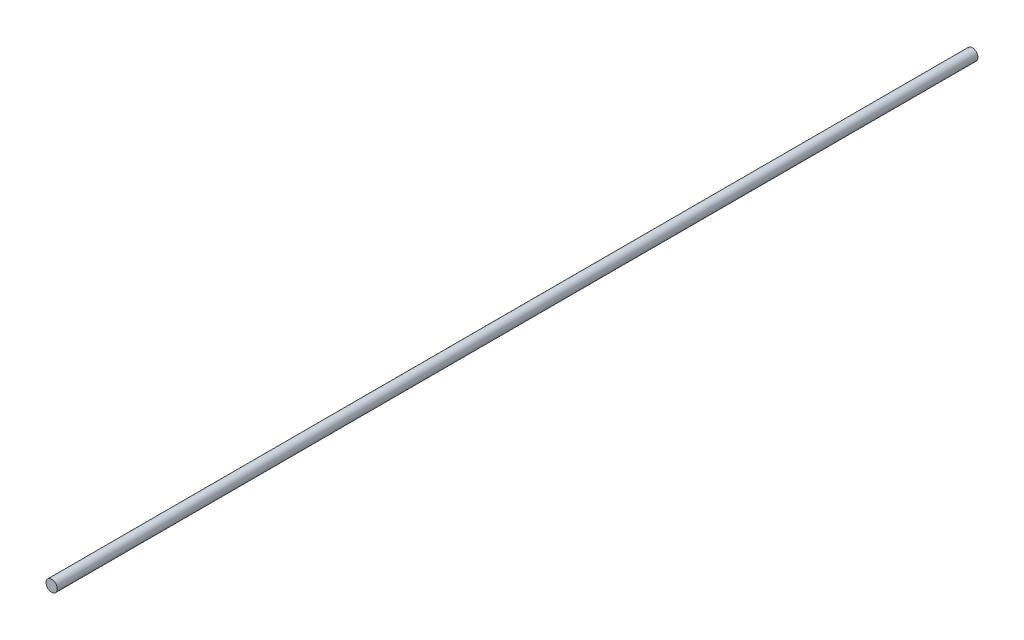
ISO-10303-21;
HEADER;
FILE_DESCRIPTION(('STEP AP214'),'2;1');
FILE_NAME('part.step','',(''),(''),'','','');
FILE_SCHEMA(('AUTOMOTIVE_DESIGN { 1 0 10303 214 1 1 1 1 }'));
ENDSEC;
DATA;
#1=APPLICATION_CONTEXT('core data for automotive mechanical design processes');
#2=APPLICATION_PROTOCOL_DEFINITION('international standard','automotive_design',2000,#1);
#3=PRODUCT_CONTEXT('',#1,'mechanical');
#4=PRODUCT('Part','Part','',(#3));
#5=PRODUCT_RELATED_PRODUCT_CATEGORY('part','',(#4));
#6=PRODUCT_DEFINITION_FORMATION('','',#4);
#7=PRODUCT_DEFINITION_CONTEXT('part definition',#1,'design');
#8=PRODUCT_DEFINITION('design','',#6,#7);
#9=PRODUCT_DEFINITION_SHAPE('','',#8);
#10=(LENGTH_UNIT() NAMED_UNIT(*) SI_UNIT(.MILLI.,.METRE.));
#11=(NAMED_UNIT(*) PLANE_ANGLE_UNIT() SI_UNIT($,.RADIAN.));
#12=(NAMED_UNIT(*) SI_UNIT($,.STERADIAN.) SOLID_ANGLE_UNIT());
#13=UNCERTAINTY_MEASURE_WITH_UNIT(LENGTH_MEASURE(1.E-05),#10,'distance_accuracy_value','');
#14=(GEOMETRIC_REPRESENTATION_CONTEXT(3) GLOBAL_UNCERTAINTY_ASSIGNED_CONTEXT((#13)) GLOBAL_UNIT_ASSIGNED_CONTEXT((#10,
#11,#12)) REPRESENTATION_CONTEXT('',''));
#15=CARTESIAN_POINT('',(0.,0.,0.));
#16=DIRECTION('',(0.,0.,1.));
#17=DIRECTION('',(1.,0.,0.));
#18=AXIS2_PLACEMENT_3D('',#15,#16,#17);
#19=CARTESIAN_POINT('',(0.,0.,-4900.));
#20=DIRECTION('',(0.,0.,1.));
#21=DIRECTION('',(1.,0.,0.));
#22=AXIS2_PLACEMENT_3D('',#19,#20,#21);
#23=CYLINDRICAL_SURFACE('',#22,30.);
#24=CARTESIAN_POINT('',(0.,0.,-4900.));
#25=DIRECTION('',(0.,0.,1.));
#26=DIRECTION('',(1.,0.,0.));
#27=AXIS2_PLACEMENT_3D('',#24,#25,#26);
#28=CIRCLE('',#27,30.);
#29=CARTESIAN_POINT('',(30.,0.,-4900.));
#30=VERTEX_POINT('',#29);
#31=EDGE_CURVE('E10',#30,#30,#28,.T.);
#32=ORIENTED_EDGE('',*,*,#31,.T.);
#33=EDGE_LOOP('',(#32));
#34=FACE_BOUND('',#33,.T.);
#35=CARTESIAN_POINT('',(0.,0.,0.));
#36=DIRECTION('',(0.,0.,1.));
#37=DIRECTION('',(1.,0.,0.));
#38=AXIS2_PLACEMENT_3D('',#35,#36,#37);
#39=CIRCLE('',#38,30.);
#40=CARTESIAN_POINT('',(30.,0.,0.));
#41=VERTEX_POINT('',#40);
#42=EDGE_CURVE('E40',#41,#41,#39,.T.);
#43=ORIENTED_EDGE('',*,*,#42,.F.);
#44=EDGE_LOOP('',(#43));
#45=FACE_BOUND('',#44,.T.);
#46=ADVANCED_FACE('F37',(#34,#45),#23,.T.);
#47=CARTESIAN_POINT('',(0.,0.,-4900.));
#48=DIRECTION('',(0.,0.,1.));
#49=DIRECTION('',(1.,0.,0.));
#50=AXIS2_PLACEMENT_3D('',#47,#48,#49);
#51=PLANE('',#50);
#52=ORIENTED_EDGE('',*,*,#31,.F.);
#53=EDGE_LOOP('',(#52));
#54=FACE_BOUND('',#53,.T.);
#55=ADVANCED_FACE('F54',(#54),#51,.F.);
#56=CARTESIAN_POINT('',(0.,0.,0.));
#57=DIRECTION('',(0.,0.,1.));
#58=DIRECTION('',(1.,0.,0.));
#59=AXIS2_PLACEMENT_3D('',#56,#57,#58);
#60=PLANE('',#59);
#61=ORIENTED_EDGE('',*,*,#42,.T.);
#62=EDGE_LOOP('',(#61));
#63=FACE_BOUND('',#62,.T.);
#64=ADVANCED_FACE('F51',(#63),#60,.T.);
#65=CLOSED_SHELL('',(#46,#55,#64));
#66=MANIFOLD_SOLID_BREP('B2',#65);
#67=ADVANCED_BREP_SHAPE_REPRESENTATION('',(#18,#66),#14);
#68=SHAPE_DEFINITION_REPRESENTATION(#9,#67);
ENDSEC;
END-ISO-10303-21;
